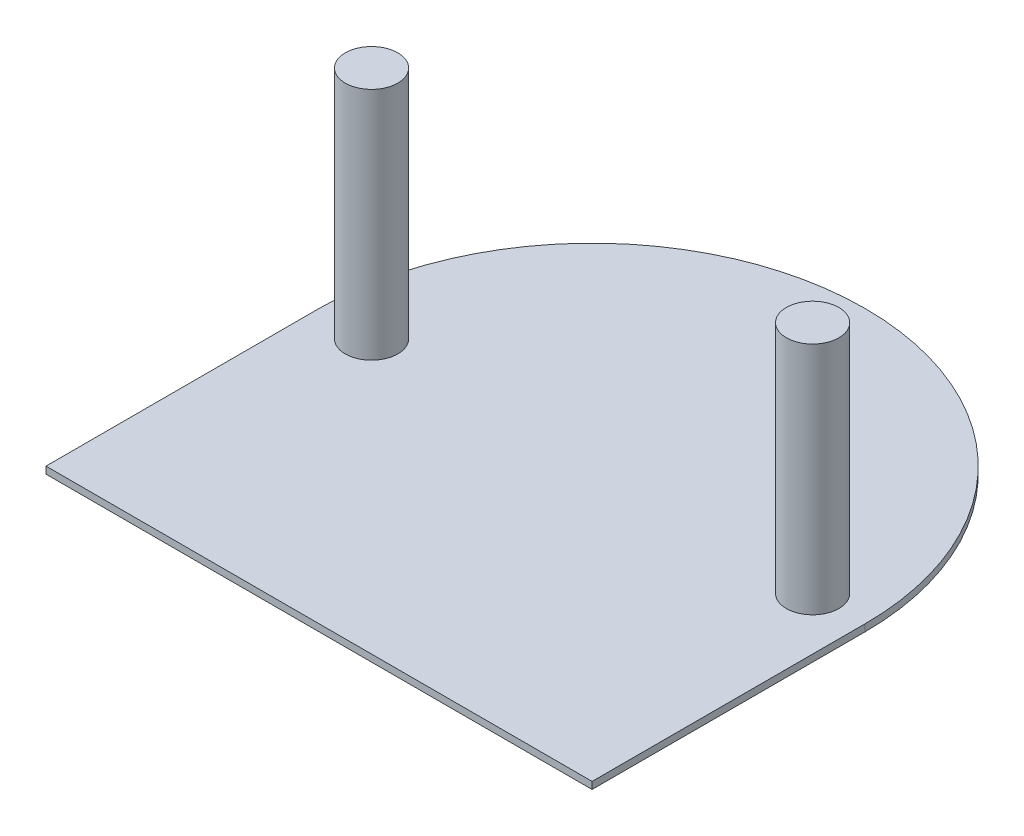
ISO-10303-21;
HEADER;
FILE_DESCRIPTION(('STEP AP214'),'2;1');
FILE_NAME('part.step','',(''),(''),'','','');
FILE_SCHEMA(('AUTOMOTIVE_DESIGN { 1 0 10303 214 1 1 1 1 }'));
ENDSEC;
DATA;
#1=APPLICATION_CONTEXT('core data for automotive mechanical design processes');
#2=APPLICATION_PROTOCOL_DEFINITION('international standard','automotive_design',2000,#1);
#3=PRODUCT_CONTEXT('',#1,'mechanical');
#4=PRODUCT('Part','Part','',(#3));
#5=PRODUCT_RELATED_PRODUCT_CATEGORY('part','',(#4));
#6=PRODUCT_DEFINITION_FORMATION('','',#4);
#7=PRODUCT_DEFINITION_CONTEXT('part definition',#1,'design');
#8=PRODUCT_DEFINITION('design','',#6,#7);
#9=PRODUCT_DEFINITION_SHAPE('','',#8);
#10=(LENGTH_UNIT() NAMED_UNIT(*) SI_UNIT(.MILLI.,.METRE.));
#11=(NAMED_UNIT(*) PLANE_ANGLE_UNIT() SI_UNIT($,.RADIAN.));
#12=(NAMED_UNIT(*) SI_UNIT($,.STERADIAN.) SOLID_ANGLE_UNIT());
#13=UNCERTAINTY_MEASURE_WITH_UNIT(LENGTH_MEASURE(1.E-05),#10,'distance_accuracy_value','');
#14=(GEOMETRIC_REPRESENTATION_CONTEXT(3) GLOBAL_UNCERTAINTY_ASSIGNED_CONTEXT((#13)) GLOBAL_UNIT_ASSIGNED_CONTEXT((#10,
#11,#12)) REPRESENTATION_CONTEXT('',''));
#15=CARTESIAN_POINT('',(0.,0.,0.));
#16=DIRECTION('',(0.,0.,1.));
#17=DIRECTION('',(1.,0.,0.));
#18=AXIS2_PLACEMENT_3D('',#15,#16,#17);
#19=CARTESIAN_POINT('',(0.,2.54,0.));
#20=DIRECTION('',(0.,1.,0.));
#21=DIRECTION('',(0.,0.,1.));
#22=AXIS2_PLACEMENT_3D('',#19,#20,#21);
#23=PLANE('',#22);
#24=CARTESIAN_POINT('',(-80.01,2.54,0.));
#25=DIRECTION('',(0.,1.,0.));
#26=DIRECTION('',(0.,0.,1.));
#27=AXIS2_PLACEMENT_3D('',#24,#25,#26);
#28=CIRCLE('',#27,9.52500000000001);
#29=CARTESIAN_POINT('',(-80.01,2.54,9.52500000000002));
#30=VERTEX_POINT('',#29);
#31=EDGE_CURVE('E139',#30,#30,#28,.T.);
#32=ORIENTED_EDGE('',*,*,#31,.F.);
#33=EDGE_LOOP('',(#32));
#34=FACE_BOUND('',#33,.T.);
#35=CARTESIAN_POINT('',(0.,2.54,0.));
#36=DIRECTION('',(0.,1.,0.));
#37=DIRECTION('',(0.,0.,1.));
#38=AXIS2_PLACEMENT_3D('',#35,#36,#37);
#39=CIRCLE('',#38,99.06);
#40=CARTESIAN_POINT('',(99.06,2.54,0.));
#41=VERTEX_POINT('',#40);
#42=CARTESIAN_POINT('',(-99.06,2.54,0.));
#43=VERTEX_POINT('',#42);
#44=EDGE_CURVE('E98',#41,#43,#39,.T.);
#45=ORIENTED_EDGE('',*,*,#44,.T.);
#46=DIRECTION('',(0.,0.,1.));
#47=VECTOR('',#46,1.);
#48=CARTESIAN_POINT('',(-99.06,2.54,0.));
#49=LINE('',#48,#47);
#50=CARTESIAN_POINT('',(-99.06,2.54,99.06));
#51=VERTEX_POINT('',#50);
#52=EDGE_CURVE('E91',#43,#51,#49,.T.);
#53=ORIENTED_EDGE('',*,*,#52,.T.);
#54=DIRECTION('',(1.,0.,0.));
#55=VECTOR('',#54,1.);
#56=CARTESIAN_POINT('',(0.,2.54,99.06));
#57=LINE('',#56,#55);
#58=CARTESIAN_POINT('',(99.06,2.54,99.06));
#59=VERTEX_POINT('',#58);
#60=EDGE_CURVE('E97',#51,#59,#57,.T.);
#61=ORIENTED_EDGE('',*,*,#60,.T.);
#62=DIRECTION('',(0.,0.,1.));
#63=VECTOR('',#62,1.);
#64=CARTESIAN_POINT('',(99.06,2.54,0.));
#65=LINE('',#64,#63);
#66=EDGE_CURVE('E110',#41,#59,#65,.T.);
#67=ORIENTED_EDGE('',*,*,#66,.F.);
#68=EDGE_LOOP('',(#45,#53,#61,#67));
#69=FACE_BOUND('',#68,.T.);
#70=CARTESIAN_POINT('',(80.01,2.54,0.));
#71=DIRECTION('',(0.,1.,0.));
#72=DIRECTION('',(0.,0.,1.));
#73=AXIS2_PLACEMENT_3D('',#70,#71,#72);
#74=CIRCLE('',#73,9.52500000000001);
#75=CARTESIAN_POINT('',(80.01,2.54,9.52500000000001));
#76=VERTEX_POINT('',#75);
#77=EDGE_CURVE('E146',#76,#76,#74,.T.);
#78=ORIENTED_EDGE('',*,*,#77,.F.);
#79=EDGE_LOOP('',(#78));
#80=FACE_BOUND('',#79,.T.);
#81=ADVANCED_FACE('F47',(#34,#69,#80),#23,.T.);
#82=CARTESIAN_POINT('',(0.,2.54,0.));
#83=DIRECTION('',(0.,-1.,0.));
#84=DIRECTION('',(0.,0.,-1.));
#85=AXIS2_PLACEMENT_3D('',#82,#83,#84);
#86=CYLINDRICAL_SURFACE('',#85,99.06);
#87=CARTESIAN_POINT('',(0.,0.,0.));
#88=DIRECTION('',(0.,1.,0.));
#89=DIRECTION('',(0.,0.,1.));
#90=AXIS2_PLACEMENT_3D('',#87,#88,#89);
#91=CIRCLE('',#90,99.06);
#92=CARTESIAN_POINT('',(99.06,0.,0.));
#93=VERTEX_POINT('',#92);
#94=CARTESIAN_POINT('',(-99.06,0.,0.));
#95=VERTEX_POINT('',#94);
#96=EDGE_CURVE('E116',#93,#95,#91,.T.);
#97=ORIENTED_EDGE('',*,*,#96,.T.);
#98=DIRECTION('',(0.,-1.,0.));
#99=VECTOR('',#98,1.);
#100=CARTESIAN_POINT('',(-99.06,2.54,0.));
#101=LINE('',#100,#99);
#102=EDGE_CURVE('E11',#43,#95,#101,.T.);
#103=ORIENTED_EDGE('',*,*,#102,.F.);
#104=ORIENTED_EDGE('',*,*,#44,.F.);
#105=DIRECTION('',(0.,-1.,0.));
#106=VECTOR('',#105,1.);
#107=CARTESIAN_POINT('',(99.06,2.54,0.));
#108=LINE('',#107,#106);
#109=EDGE_CURVE('E65',#41,#93,#108,.T.);
#110=ORIENTED_EDGE('',*,*,#109,.T.);
#111=EDGE_LOOP('',(#97,#103,#104,#110));
#112=FACE_BOUND('',#111,.T.);
#113=ADVANCED_FACE('F49',(#112),#86,.T.);
#114=CARTESIAN_POINT('',(-99.06,2.54,0.));
#115=DIRECTION('',(1.,0.,0.));
#116=DIRECTION('',(0.,0.,-1.));
#117=AXIS2_PLACEMENT_3D('',#114,#115,#116);
#118=PLANE('',#117);
#119=DIRECTION('',(0.,0.,1.));
#120=VECTOR('',#119,1.);
#121=CARTESIAN_POINT('',(-99.06,0.,0.));
#122=LINE('',#121,#120);
#123=CARTESIAN_POINT('',(-99.06,0.,99.06));
#124=VERTEX_POINT('',#123);
#125=EDGE_CURVE('E104',#95,#124,#122,.T.);
#126=ORIENTED_EDGE('',*,*,#125,.T.);
#127=DIRECTION('',(0.,-1.,0.));
#128=VECTOR('',#127,1.);
#129=CARTESIAN_POINT('',(-99.06,2.54,99.06));
#130=LINE('',#129,#128);
#131=EDGE_CURVE('E57',#51,#124,#130,.T.);
#132=ORIENTED_EDGE('',*,*,#131,.F.);
#133=ORIENTED_EDGE('',*,*,#52,.F.);
#134=ORIENTED_EDGE('',*,*,#102,.T.);
#135=EDGE_LOOP('',(#126,#132,#133,#134));
#136=FACE_BOUND('',#135,.T.);
#137=ADVANCED_FACE('F103',(#136),#118,.F.);
#138=CARTESIAN_POINT('',(0.,2.54,99.06));
#139=DIRECTION('',(0.,0.,-1.));
#140=DIRECTION('',(-1.,0.,0.));
#141=AXIS2_PLACEMENT_3D('',#138,#139,#140);
#142=PLANE('',#141);
#143=DIRECTION('',(1.,0.,0.));
#144=VECTOR('',#143,1.);
#145=CARTESIAN_POINT('',(0.,0.,99.06));
#146=LINE('',#145,#144);
#147=CARTESIAN_POINT('',(99.06,0.,99.06));
#148=VERTEX_POINT('',#147);
#149=EDGE_CURVE('E122',#124,#148,#146,.T.);
#150=ORIENTED_EDGE('',*,*,#149,.T.);
#151=DIRECTION('',(0.,-1.,0.));
#152=VECTOR('',#151,1.);
#153=CARTESIAN_POINT('',(99.06,2.54,99.06));
#154=LINE('',#153,#152);
#155=EDGE_CURVE('E80',#59,#148,#154,.T.);
#156=ORIENTED_EDGE('',*,*,#155,.F.);
#157=ORIENTED_EDGE('',*,*,#60,.F.);
#158=ORIENTED_EDGE('',*,*,#131,.T.);
#159=EDGE_LOOP('',(#150,#156,#157,#158));
#160=FACE_BOUND('',#159,.T.);
#161=ADVANCED_FACE('F108',(#160),#142,.F.);
#162=CARTESIAN_POINT('',(99.06,2.54,0.));
#163=DIRECTION('',(1.,0.,0.));
#164=DIRECTION('',(0.,0.,-1.));
#165=AXIS2_PLACEMENT_3D('',#162,#163,#164);
#166=PLANE('',#165);
#167=DIRECTION('',(0.,0.,1.));
#168=VECTOR('',#167,1.);
#169=CARTESIAN_POINT('',(99.06,0.,0.));
#170=LINE('',#169,#168);
#171=EDGE_CURVE('E125',#93,#148,#170,.T.);
#172=ORIENTED_EDGE('',*,*,#171,.F.);
#173=ORIENTED_EDGE('',*,*,#109,.F.);
#174=ORIENTED_EDGE('',*,*,#66,.T.);
#175=ORIENTED_EDGE('',*,*,#155,.T.);
#176=EDGE_LOOP('',(#172,#173,#174,#175));
#177=FACE_BOUND('',#176,.T.);
#178=ADVANCED_FACE('F200',(#177),#166,.T.);
#179=CARTESIAN_POINT('',(0.,0.,0.));
#180=DIRECTION('',(0.,1.,0.));
#181=DIRECTION('',(0.,0.,1.));
#182=AXIS2_PLACEMENT_3D('',#179,#180,#181);
#183=PLANE('',#182);
#184=CARTESIAN_POINT('',(-80.01,0.,0.));
#185=DIRECTION('',(0.,1.,0.));
#186=DIRECTION('',(0.,0.,1.));
#187=AXIS2_PLACEMENT_3D('',#184,#185,#186);
#188=CIRCLE('',#187,6.35);
#189=CARTESIAN_POINT('',(-80.01,0.,6.35));
#190=VERTEX_POINT('',#189);
#191=EDGE_CURVE('E119',#190,#190,#188,.T.);
#192=ORIENTED_EDGE('',*,*,#191,.T.);
#193=EDGE_LOOP('',(#192));
#194=FACE_BOUND('',#193,.T.);
#195=CARTESIAN_POINT('',(80.01,0.,0.));
#196=DIRECTION('',(0.,1.,0.));
#197=DIRECTION('',(0.,0.,-1.));
#198=AXIS2_PLACEMENT_3D('',#195,#196,#197);
#199=CIRCLE('',#198,6.35);
#200=CARTESIAN_POINT('',(80.01,0.,-6.35));
#201=VERTEX_POINT('',#200);
#202=EDGE_CURVE('E135',#201,#201,#199,.T.);
#203=ORIENTED_EDGE('',*,*,#202,.T.);
#204=EDGE_LOOP('',(#203));
#205=FACE_BOUND('',#204,.T.);
#206=ORIENTED_EDGE('',*,*,#96,.F.);
#207=ORIENTED_EDGE('',*,*,#171,.T.);
#208=ORIENTED_EDGE('',*,*,#149,.F.);
#209=ORIENTED_EDGE('',*,*,#125,.F.);
#210=EDGE_LOOP('',(#206,#207,#208,#209));
#211=FACE_BOUND('',#210,.T.);
#212=ADVANCED_FACE('F198',(#194,#205,#211),#183,.F.);
#213=CARTESIAN_POINT('',(80.01,0.,0.));
#214=DIRECTION('',(0.,1.,0.));
#215=DIRECTION('',(0.,0.,1.));
#216=AXIS2_PLACEMENT_3D('',#213,#214,#215);
#217=CYLINDRICAL_SURFACE('',#216,6.35);
#218=ORIENTED_EDGE('',*,*,#202,.F.);
#219=EDGE_LOOP('',(#218));
#220=FACE_BOUND('',#219,.T.);
#221=CARTESIAN_POINT('',(80.01,85.09,0.));
#222=DIRECTION('',(0.,1.,0.));
#223=DIRECTION('',(0.,0.,1.));
#224=AXIS2_PLACEMENT_3D('',#221,#222,#223);
#225=CIRCLE('',#224,6.35);
#226=CARTESIAN_POINT('',(80.01,85.09,6.35));
#227=VERTEX_POINT('',#226);
#228=EDGE_CURVE('E152',#227,#227,#225,.T.);
#229=ORIENTED_EDGE('',*,*,#228,.T.);
#230=EDGE_LOOP('',(#229));
#231=FACE_BOUND('',#230,.T.);
#232=ADVANCED_FACE('F196',(#220,#231),#217,.F.);
#233=CARTESIAN_POINT('',(-80.01,0.,0.));
#234=DIRECTION('',(0.,1.,0.));
#235=DIRECTION('',(0.,0.,1.));
#236=AXIS2_PLACEMENT_3D('',#233,#234,#235);
#237=CYLINDRICAL_SURFACE('',#236,6.35);
#238=ORIENTED_EDGE('',*,*,#191,.F.);
#239=EDGE_LOOP('',(#238));
#240=FACE_BOUND('',#239,.T.);
#241=CARTESIAN_POINT('',(-80.01,85.09,0.));
#242=DIRECTION('',(0.,1.,0.));
#243=DIRECTION('',(0.,0.,1.));
#244=AXIS2_PLACEMENT_3D('',#241,#242,#243);
#245=CIRCLE('',#244,6.35);
#246=CARTESIAN_POINT('',(-80.01,85.09,6.35));
#247=VERTEX_POINT('',#246);
#248=EDGE_CURVE('E147',#247,#247,#245,.T.);
#249=ORIENTED_EDGE('',*,*,#248,.T.);
#250=EDGE_LOOP('',(#249));
#251=FACE_BOUND('',#250,.T.);
#252=ADVANCED_FACE('F182',(#240,#251),#237,.F.);
#253=CARTESIAN_POINT('',(-80.01,85.09,0.));
#254=DIRECTION('',(0.,-1.,0.));
#255=DIRECTION('',(0.,0.,-1.));
#256=AXIS2_PLACEMENT_3D('',#253,#254,#255);
#257=CYLINDRICAL_SURFACE('',#256,9.52500000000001);
#258=ORIENTED_EDGE('',*,*,#31,.T.);
#259=EDGE_LOOP('',(#258));
#260=FACE_BOUND('',#259,.T.);
#261=CARTESIAN_POINT('',(-80.01,87.63,0.));
#262=DIRECTION('',(0.,1.,0.));
#263=DIRECTION('',(0.,0.,1.));
#264=AXIS2_PLACEMENT_3D('',#261,#262,#263);
#265=CIRCLE('',#264,9.52500000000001);
#266=CARTESIAN_POINT('',(-80.01,87.63,9.52500000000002));
#267=VERTEX_POINT('',#266);
#268=EDGE_CURVE('E151',#267,#267,#265,.T.);
#269=ORIENTED_EDGE('',*,*,#268,.F.);
#270=EDGE_LOOP('',(#269));
#271=FACE_BOUND('',#270,.T.);
#272=ADVANCED_FACE('F172',(#260,#271),#257,.T.);
#273=CARTESIAN_POINT('',(80.01,85.09,0.));
#274=DIRECTION('',(0.,-1.,0.));
#275=DIRECTION('',(0.,0.,-1.));
#276=AXIS2_PLACEMENT_3D('',#273,#274,#275);
#277=CYLINDRICAL_SURFACE('',#276,9.52500000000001);
#278=ORIENTED_EDGE('',*,*,#77,.T.);
#279=EDGE_LOOP('',(#278));
#280=FACE_BOUND('',#279,.T.);
#281=CARTESIAN_POINT('',(80.01,87.63,0.));
#282=DIRECTION('',(0.,1.,0.));
#283=DIRECTION('',(0.,0.,1.));
#284=AXIS2_PLACEMENT_3D('',#281,#282,#283);
#285=CIRCLE('',#284,9.52500000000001);
#286=CARTESIAN_POINT('',(80.01,87.63,9.52500000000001));
#287=VERTEX_POINT('',#286);
#288=EDGE_CURVE('E156',#287,#287,#285,.T.);
#289=ORIENTED_EDGE('',*,*,#288,.F.);
#290=EDGE_LOOP('',(#289));
#291=FACE_BOUND('',#290,.T.);
#292=ADVANCED_FACE('F169',(#280,#291),#277,.T.);
#293=CARTESIAN_POINT('',(-80.01,85.09,0.));
#294=DIRECTION('',(0.,1.,0.));
#295=DIRECTION('',(0.,0.,1.));
#296=AXIS2_PLACEMENT_3D('',#293,#294,#295);
#297=PLANE('',#296);
#298=ORIENTED_EDGE('',*,*,#248,.F.);
#299=EDGE_LOOP('',(#298));
#300=FACE_BOUND('',#299,.T.);
#301=ADVANCED_FACE('F171',(#300),#297,.F.);
#302=CARTESIAN_POINT('',(-80.01,87.63,0.));
#303=DIRECTION('',(0.,1.,0.));
#304=DIRECTION('',(0.,0.,1.));
#305=AXIS2_PLACEMENT_3D('',#302,#303,#304);
#306=PLANE('',#305);
#307=ORIENTED_EDGE('',*,*,#268,.T.);
#308=EDGE_LOOP('',(#307));
#309=FACE_BOUND('',#308,.T.);
#310=ADVANCED_FACE('F179',(#309),#306,.T.);
#311=CARTESIAN_POINT('',(80.01,85.09,0.));
#312=DIRECTION('',(0.,1.,0.));
#313=DIRECTION('',(0.,0.,1.));
#314=AXIS2_PLACEMENT_3D('',#311,#312,#313);
#315=PLANE('',#314);
#316=ORIENTED_EDGE('',*,*,#228,.F.);
#317=EDGE_LOOP('',(#316));
#318=FACE_BOUND('',#317,.T.);
#319=ADVANCED_FACE('F262',(#318),#315,.F.);
#320=CARTESIAN_POINT('',(80.01,87.63,0.));
#321=DIRECTION('',(0.,1.,0.));
#322=DIRECTION('',(0.,0.,1.));
#323=AXIS2_PLACEMENT_3D('',#320,#321,#322);
#324=PLANE('',#323);
#325=ORIENTED_EDGE('',*,*,#288,.T.);
#326=EDGE_LOOP('',(#325));
#327=FACE_BOUND('',#326,.T.);
#328=ADVANCED_FACE('F167',(#327),#324,.T.);
#329=CLOSED_SHELL('',(#81,#113,#137,#161,#178,#212,#232,#252,#272,#292,#301,#310,#319,#328));
#330=MANIFOLD_SOLID_BREP('B2',#329);
#331=ADVANCED_BREP_SHAPE_REPRESENTATION('',(#18,#330),#14);
#332=SHAPE_DEFINITION_REPRESENTATION(#9,#331);
ENDSEC;
END-ISO-10303-21;
